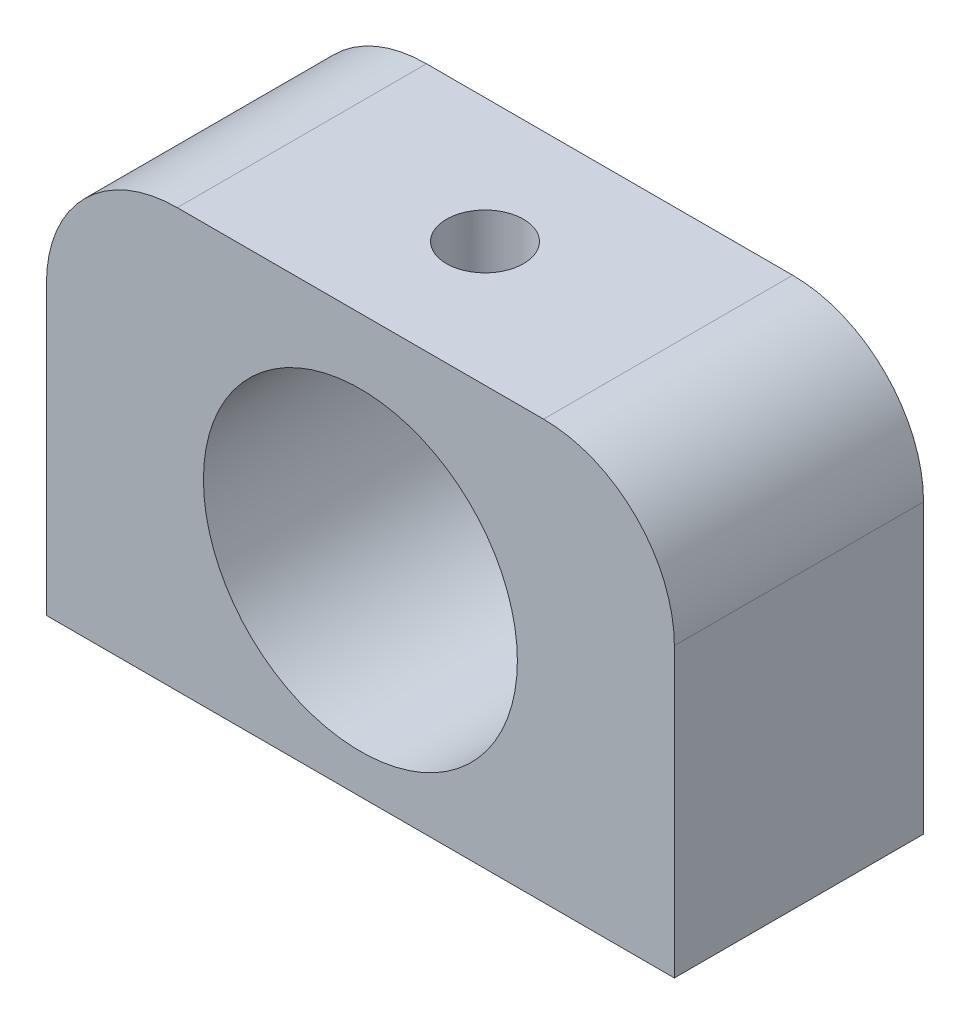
from build123d import *

# Parameters (mm, degrees)
SKETCH1_W                 = 24
SKETCH1_H                 = 16
BOSS_EXTRUDE1_DEPTH       = 9.525
F_4_CLEARANCE_HOLE1_D     = 3.2639
F_4_CLEARANCE_HOLE1_DEPTH = 12.7
F_4_CLEARANCE_HOLE1_TIP   = 0.980574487
SKETCH8_R                 = 6
CUT_EXTRUDE1_DEPTH        = 31.376399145
F_4_CLEARANCE_HOLE2_D     = 2.9464
F_4_CLEARANCE_HOLE2_DEPTH = 5
F_4_CLEARANCE_HOLE2_TIP   = 0.885187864
FILLET2_R                 = 5


with BuildPart() as part:
    # Sketch1 → Boss-Extrude1 (new body)
    with BuildSketch(Plane.XY):
        with Locations((12, 8)):
            Rectangle(SKETCH1_W, SKETCH1_H)
    extrude(amount=BOSS_EXTRUDE1_DEPTH)

    # 4 Clearance Hole1
    with Locations(Plane(origin=(0, 0, 0), x_dir=(-1, 0, 0), z_dir=(0, -1, 0))):
        with Locations((-3, -4.7625), (-21, -4.7625)):
            Hole(F_4_CLEARANCE_HOLE1_D / 2, depth=F_4_CLEARANCE_HOLE1_DEPTH)
            with Locations((0, 0, -(F_4_CLEARANCE_HOLE1_DEPTH + F_4_CLEARANCE_HOLE1_TIP / 2))):  # 118° drill point
                Cone(0, F_4_CLEARANCE_HOLE1_D / 2, F_4_CLEARANCE_HOLE1_TIP, mode=Mode.SUBTRACT)

    # Sketch8 → Cut-Extrude1 (cut, through all)
    with BuildSketch(Plane.XY.offset(9.525)):
        with Locations((12, 7.5)):
            Circle(SKETCH8_R)
    extrude(amount=-CUT_EXTRUDE1_DEPTH, mode=Mode.SUBTRACT)

    # 4 Clearance Hole2
    with Locations(Plane(origin=(0, 16, 0), x_dir=(1, 0, 0), z_dir=(0, 1, 0))):
        with Locations((12, -4.7625)):
            Hole(F_4_CLEARANCE_HOLE2_D / 2, depth=F_4_CLEARANCE_HOLE2_DEPTH)
            with Locations((0, 0, -(F_4_CLEARANCE_HOLE2_DEPTH + F_4_CLEARANCE_HOLE2_TIP / 2))):  # 118° drill point
                Cone(0, F_4_CLEARANCE_HOLE2_D / 2, F_4_CLEARANCE_HOLE2_TIP, mode=Mode.SUBTRACT)

    # Fillet2
    fillet2_edges = [part.edges().sort_by_distance(p)[0] for p in [
        (0, 16, 4.7625),
        (24, 16, 4.7625),
    ]]
    fillet(fillet2_edges, radius=FILLET2_R)


solid = part.part
